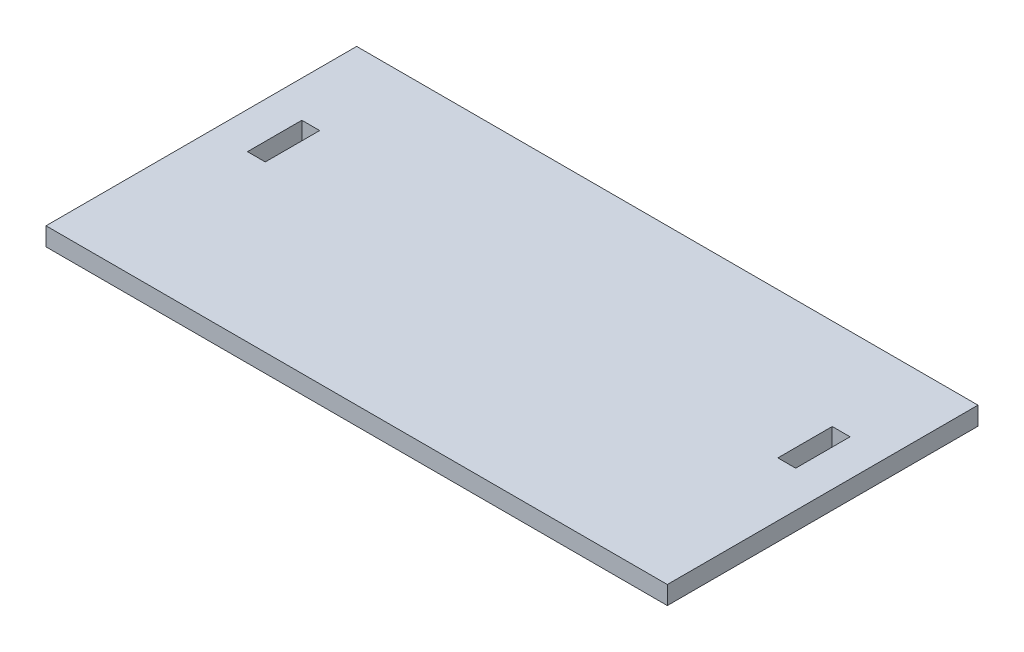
ISO-10303-21;
HEADER;
FILE_DESCRIPTION(('STEP AP214'),'2;1');
FILE_NAME('part.step','',(''),(''),'','','');
FILE_SCHEMA(('AUTOMOTIVE_DESIGN { 1 0 10303 214 1 1 1 1 }'));
ENDSEC;
DATA;
#1=APPLICATION_CONTEXT('core data for automotive mechanical design processes');
#2=APPLICATION_PROTOCOL_DEFINITION('international standard','automotive_design',2000,#1);
#3=PRODUCT_CONTEXT('',#1,'mechanical');
#4=PRODUCT('Part','Part','',(#3));
#5=PRODUCT_RELATED_PRODUCT_CATEGORY('part','',(#4));
#6=PRODUCT_DEFINITION_FORMATION('','',#4);
#7=PRODUCT_DEFINITION_CONTEXT('part definition',#1,'design');
#8=PRODUCT_DEFINITION('design','',#6,#7);
#9=PRODUCT_DEFINITION_SHAPE('','',#8);
#10=(LENGTH_UNIT() NAMED_UNIT(*) SI_UNIT(.MILLI.,.METRE.));
#11=(NAMED_UNIT(*) PLANE_ANGLE_UNIT() SI_UNIT($,.RADIAN.));
#12=(NAMED_UNIT(*) SI_UNIT($,.STERADIAN.) SOLID_ANGLE_UNIT());
#13=UNCERTAINTY_MEASURE_WITH_UNIT(LENGTH_MEASURE(1.E-05),#10,'distance_accuracy_value','');
#14=(GEOMETRIC_REPRESENTATION_CONTEXT(3) GLOBAL_UNCERTAINTY_ASSIGNED_CONTEXT((#13)) GLOBAL_UNIT_ASSIGNED_CONTEXT((#10,
#11,#12)) REPRESENTATION_CONTEXT('',''));
#15=CARTESIAN_POINT('',(0.,0.,0.));
#16=DIRECTION('',(0.,0.,1.));
#17=DIRECTION('',(1.,0.,0.));
#18=AXIS2_PLACEMENT_3D('',#15,#16,#17);
#19=CARTESIAN_POINT('',(0.,10.,0.));
#20=DIRECTION('',(0.,1.,0.));
#21=DIRECTION('',(0.,0.,1.));
#22=AXIS2_PLACEMENT_3D('',#19,#20,#21);
#23=PLANE('',#22);
#24=DIRECTION('',(0.,0.,1.));
#25=VECTOR('',#24,1.);
#26=CARTESIAN_POINT('',(-68.7616014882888,10.,-58.2175310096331));
#27=LINE('',#26,#25);
#28=CARTESIAN_POINT('',(-68.7616014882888,10.,-58.2175310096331));
#29=VERTEX_POINT('',#28);
#30=CARTESIAN_POINT('',(-68.7616014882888,10.,111.782468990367));
#31=VERTEX_POINT('',#30);
#32=EDGE_CURVE('E214',#29,#31,#27,.T.);
#33=ORIENTED_EDGE('',*,*,#32,.T.);
#34=DIRECTION('',(1.,0.,0.));
#35=VECTOR('',#34,1.);
#36=CARTESIAN_POINT('',(-68.7616014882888,10.,111.782468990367));
#37=LINE('',#36,#35);
#38=CARTESIAN_POINT('',(271.238398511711,10.,111.782468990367));
#39=VERTEX_POINT('',#38);
#40=EDGE_CURVE('E219',#31,#39,#37,.T.);
#41=ORIENTED_EDGE('',*,*,#40,.T.);
#42=DIRECTION('',(0.,0.,-1.));
#43=VECTOR('',#42,1.);
#44=CARTESIAN_POINT('',(271.238398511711,10.,-58.2175310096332));
#45=LINE('',#44,#43);
#46=CARTESIAN_POINT('',(271.238398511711,10.,-58.2175310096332));
#47=VERTEX_POINT('',#46);
#48=EDGE_CURVE('E227',#39,#47,#45,.T.);
#49=ORIENTED_EDGE('',*,*,#48,.T.);
#50=DIRECTION('',(-1.,0.,0.));
#51=VECTOR('',#50,1.);
#52=CARTESIAN_POINT('',(-68.7616014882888,10.,-58.2175310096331));
#53=LINE('',#52,#51);
#54=EDGE_CURVE('E230',#47,#29,#53,.T.);
#55=ORIENTED_EDGE('',*,*,#54,.T.);
#56=EDGE_LOOP('',(#33,#41,#49,#55));
#57=FACE_BOUND('',#56,.T.);
#58=DIRECTION('',(1.,0.,0.));
#59=VECTOR('',#58,1.);
#60=CARTESIAN_POINT('',(-48.7616014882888,10.,21.5424689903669));
#61=LINE('',#60,#59);
#62=CARTESIAN_POINT('',(-48.7616014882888,10.,21.5424689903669));
#63=VERTEX_POINT('',#62);
#64=CARTESIAN_POINT('',(-39.0016014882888,10.,21.5424689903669));
#65=VERTEX_POINT('',#64);
#66=EDGE_CURVE('E180',#63,#65,#61,.T.);
#67=ORIENTED_EDGE('',*,*,#66,.F.);
#68=DIRECTION('',(0.,0.,1.));
#69=VECTOR('',#68,1.);
#70=CARTESIAN_POINT('',(-48.7616014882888,10.,-8.21753100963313));
#71=LINE('',#70,#69);
#72=CARTESIAN_POINT('',(-48.7616014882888,10.,-8.21753100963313));
#73=VERTEX_POINT('',#72);
#74=EDGE_CURVE('E176',#73,#63,#71,.T.);
#75=ORIENTED_EDGE('',*,*,#74,.F.);
#76=DIRECTION('',(-1.,0.,0.));
#77=VECTOR('',#76,1.);
#78=CARTESIAN_POINT('',(-48.7616014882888,10.,-8.21753100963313));
#79=LINE('',#78,#77);
#80=CARTESIAN_POINT('',(-39.0016014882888,10.,-8.21753100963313));
#81=VERTEX_POINT('',#80);
#82=EDGE_CURVE('E187',#81,#73,#79,.T.);
#83=ORIENTED_EDGE('',*,*,#82,.F.);
#84=DIRECTION('',(0.,0.,-1.));
#85=VECTOR('',#84,1.);
#86=CARTESIAN_POINT('',(-39.0016014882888,10.,-8.21753100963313));
#87=LINE('',#86,#85);
#88=EDGE_CURVE('E192',#65,#81,#87,.T.);
#89=ORIENTED_EDGE('',*,*,#88,.F.);
#90=EDGE_LOOP('',(#67,#75,#83,#89));
#91=FACE_BOUND('',#90,.T.);
#92=DIRECTION('',(-1.,0.,0.));
#93=VECTOR('',#92,1.);
#94=CARTESIAN_POINT('',(251.238398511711,10.,-8.21753100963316));
#95=LINE('',#94,#93);
#96=CARTESIAN_POINT('',(251.238398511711,10.,-8.21753100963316));
#97=VERTEX_POINT('',#96);
#98=CARTESIAN_POINT('',(241.478398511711,10.,-8.21753100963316));
#99=VERTEX_POINT('',#98);
#100=EDGE_CURVE('E136',#97,#99,#95,.T.);
#101=ORIENTED_EDGE('',*,*,#100,.F.);
#102=DIRECTION('',(0.,0.,-1.));
#103=VECTOR('',#102,1.);
#104=CARTESIAN_POINT('',(251.238398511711,10.,-8.21753100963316));
#105=LINE('',#104,#103);
#106=CARTESIAN_POINT('',(251.238398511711,10.,21.5424689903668));
#107=VERTEX_POINT('',#106);
#108=EDGE_CURVE('E127',#107,#97,#105,.T.);
#109=ORIENTED_EDGE('',*,*,#108,.F.);
#110=DIRECTION('',(1.,0.,0.));
#111=VECTOR('',#110,1.);
#112=CARTESIAN_POINT('',(251.238398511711,10.,21.5424689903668));
#113=LINE('',#112,#111);
#114=CARTESIAN_POINT('',(241.478398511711,10.,21.5424689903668));
#115=VERTEX_POINT('',#114);
#116=EDGE_CURVE('E153',#115,#107,#113,.T.);
#117=ORIENTED_EDGE('',*,*,#116,.F.);
#118=DIRECTION('',(0.,0.,1.));
#119=VECTOR('',#118,1.);
#120=CARTESIAN_POINT('',(241.478398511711,10.,-8.21753100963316));
#121=LINE('',#120,#119);
#122=EDGE_CURVE('E148',#99,#115,#121,.T.);
#123=ORIENTED_EDGE('',*,*,#122,.F.);
#124=EDGE_LOOP('',(#101,#109,#117,#123));
#125=FACE_BOUND('',#124,.T.);
#126=ADVANCED_FACE('F38',(#57,#91,#125),#23,.T.);
#127=CARTESIAN_POINT('',(0.,0.,0.));
#128=DIRECTION('',(0.,1.,0.));
#129=DIRECTION('',(0.,0.,1.));
#130=AXIS2_PLACEMENT_3D('',#127,#128,#129);
#131=PLANE('',#130);
#132=DIRECTION('',(0.,0.,1.));
#133=VECTOR('',#132,1.);
#134=CARTESIAN_POINT('',(-48.7616014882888,0.,-8.21753100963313));
#135=LINE('',#134,#133);
#136=CARTESIAN_POINT('',(-48.7616014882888,0.,-8.21753100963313));
#137=VERTEX_POINT('',#136);
#138=CARTESIAN_POINT('',(-48.7616014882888,0.,21.5424689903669));
#139=VERTEX_POINT('',#138);
#140=EDGE_CURVE('E144',#137,#139,#135,.T.);
#141=ORIENTED_EDGE('',*,*,#140,.T.);
#142=DIRECTION('',(1.,0.,0.));
#143=VECTOR('',#142,1.);
#144=CARTESIAN_POINT('',(-48.7616014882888,0.,21.5424689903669));
#145=LINE('',#144,#143);
#146=CARTESIAN_POINT('',(-39.0016014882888,0.,21.5424689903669));
#147=VERTEX_POINT('',#146);
#148=EDGE_CURVE('E196',#139,#147,#145,.T.);
#149=ORIENTED_EDGE('',*,*,#148,.T.);
#150=DIRECTION('',(0.,0.,-1.));
#151=VECTOR('',#150,1.);
#152=CARTESIAN_POINT('',(-39.0016014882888,0.,-8.21753100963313));
#153=LINE('',#152,#151);
#154=CARTESIAN_POINT('',(-39.0016014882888,0.,-8.21753100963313));
#155=VERTEX_POINT('',#154);
#156=EDGE_CURVE('E199',#147,#155,#153,.T.);
#157=ORIENTED_EDGE('',*,*,#156,.T.);
#158=DIRECTION('',(-1.,0.,0.));
#159=VECTOR('',#158,1.);
#160=CARTESIAN_POINT('',(-48.7616014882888,0.,-8.21753100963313));
#161=LINE('',#160,#159);
#162=EDGE_CURVE('E181',#155,#137,#161,.T.);
#163=ORIENTED_EDGE('',*,*,#162,.T.);
#164=EDGE_LOOP('',(#141,#149,#157,#163));
#165=FACE_BOUND('',#164,.T.);
#166=DIRECTION('',(0.,0.,1.));
#167=VECTOR('',#166,1.);
#168=CARTESIAN_POINT('',(-68.7616014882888,0.,-58.2175310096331));
#169=LINE('',#168,#167);
#170=CARTESIAN_POINT('',(-68.7616014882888,0.,-58.2175310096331));
#171=VERTEX_POINT('',#170);
#172=CARTESIAN_POINT('',(-68.7616014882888,0.,111.782468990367));
#173=VERTEX_POINT('',#172);
#174=EDGE_CURVE('E213',#171,#173,#169,.T.);
#175=ORIENTED_EDGE('',*,*,#174,.F.);
#176=DIRECTION('',(-1.,0.,0.));
#177=VECTOR('',#176,1.);
#178=CARTESIAN_POINT('',(-68.7616014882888,0.,-58.2175310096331));
#179=LINE('',#178,#177);
#180=CARTESIAN_POINT('',(271.238398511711,0.,-58.2175310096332));
#181=VERTEX_POINT('',#180);
#182=EDGE_CURVE('E220',#181,#171,#179,.T.);
#183=ORIENTED_EDGE('',*,*,#182,.F.);
#184=DIRECTION('',(0.,0.,-1.));
#185=VECTOR('',#184,1.);
#186=CARTESIAN_POINT('',(271.238398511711,0.,-58.2175310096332));
#187=LINE('',#186,#185);
#188=CARTESIAN_POINT('',(271.238398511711,0.,111.782468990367));
#189=VERTEX_POINT('',#188);
#190=EDGE_CURVE('E239',#189,#181,#187,.T.);
#191=ORIENTED_EDGE('',*,*,#190,.F.);
#192=DIRECTION('',(1.,0.,0.));
#193=VECTOR('',#192,1.);
#194=CARTESIAN_POINT('',(-68.7616014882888,0.,111.782468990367));
#195=LINE('',#194,#193);
#196=EDGE_CURVE('E237',#173,#189,#195,.T.);
#197=ORIENTED_EDGE('',*,*,#196,.F.);
#198=EDGE_LOOP('',(#175,#183,#191,#197));
#199=FACE_BOUND('',#198,.T.);
#200=DIRECTION('',(0.,0.,-1.));
#201=VECTOR('',#200,1.);
#202=CARTESIAN_POINT('',(251.238398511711,0.,-8.21753100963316));
#203=LINE('',#202,#201);
#204=CARTESIAN_POINT('',(251.238398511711,0.,21.5424689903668));
#205=VERTEX_POINT('',#204);
#206=CARTESIAN_POINT('',(251.238398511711,0.,-8.21753100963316));
#207=VERTEX_POINT('',#206);
#208=EDGE_CURVE('E61',#205,#207,#203,.T.);
#209=ORIENTED_EDGE('',*,*,#208,.T.);
#210=DIRECTION('',(-1.,0.,0.));
#211=VECTOR('',#210,1.);
#212=CARTESIAN_POINT('',(251.238398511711,0.,-8.21753100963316));
#213=LINE('',#212,#211);
#214=CARTESIAN_POINT('',(241.478398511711,0.,-8.21753100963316));
#215=VERTEX_POINT('',#214);
#216=EDGE_CURVE('E143',#207,#215,#213,.T.);
#217=ORIENTED_EDGE('',*,*,#216,.T.);
#218=DIRECTION('',(0.,0.,1.));
#219=VECTOR('',#218,1.);
#220=CARTESIAN_POINT('',(241.478398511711,0.,-8.21753100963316));
#221=LINE('',#220,#219);
#222=CARTESIAN_POINT('',(241.478398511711,0.,21.5424689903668));
#223=VERTEX_POINT('',#222);
#224=EDGE_CURVE('E168',#215,#223,#221,.T.);
#225=ORIENTED_EDGE('',*,*,#224,.T.);
#226=DIRECTION('',(1.,0.,0.));
#227=VECTOR('',#226,1.);
#228=CARTESIAN_POINT('',(251.238398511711,0.,21.5424689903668));
#229=LINE('',#228,#227);
#230=EDGE_CURVE('E137',#223,#205,#229,.T.);
#231=ORIENTED_EDGE('',*,*,#230,.T.);
#232=EDGE_LOOP('',(#209,#217,#225,#231));
#233=FACE_BOUND('',#232,.T.);
#234=ADVANCED_FACE('F257',(#165,#199,#233),#131,.F.);
#235=CARTESIAN_POINT('',(-68.7616014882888,10.,-58.2175310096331));
#236=DIRECTION('',(1.,0.,0.));
#237=DIRECTION('',(0.,0.,-1.));
#238=AXIS2_PLACEMENT_3D('',#235,#236,#237);
#239=PLANE('',#238);
#240=ORIENTED_EDGE('',*,*,#174,.T.);
#241=DIRECTION('',(0.,-1.,0.));
#242=VECTOR('',#241,1.);
#243=CARTESIAN_POINT('',(-68.7616014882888,10.,111.782468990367));
#244=LINE('',#243,#242);
#245=EDGE_CURVE('E12',#31,#173,#244,.T.);
#246=ORIENTED_EDGE('',*,*,#245,.F.);
#247=ORIENTED_EDGE('',*,*,#32,.F.);
#248=DIRECTION('',(0.,-1.,0.));
#249=VECTOR('',#248,1.);
#250=CARTESIAN_POINT('',(-68.7616014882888,10.,-58.2175310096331));
#251=LINE('',#250,#249);
#252=EDGE_CURVE('E234',#29,#171,#251,.T.);
#253=ORIENTED_EDGE('',*,*,#252,.T.);
#254=EDGE_LOOP('',(#240,#246,#247,#253));
#255=FACE_BOUND('',#254,.T.);
#256=ADVANCED_FACE('F40',(#255),#239,.F.);
#257=CARTESIAN_POINT('',(-68.7616014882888,10.,111.782468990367));
#258=DIRECTION('',(0.,0.,-1.));
#259=DIRECTION('',(-1.,0.,0.));
#260=AXIS2_PLACEMENT_3D('',#257,#258,#259);
#261=PLANE('',#260);
#262=ORIENTED_EDGE('',*,*,#196,.T.);
#263=DIRECTION('',(0.,-1.,0.));
#264=VECTOR('',#263,1.);
#265=CARTESIAN_POINT('',(271.238398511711,10.,111.782468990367));
#266=LINE('',#265,#264);
#267=EDGE_CURVE('E46',#39,#189,#266,.T.);
#268=ORIENTED_EDGE('',*,*,#267,.F.);
#269=ORIENTED_EDGE('',*,*,#40,.F.);
#270=ORIENTED_EDGE('',*,*,#245,.T.);
#271=EDGE_LOOP('',(#262,#268,#269,#270));
#272=FACE_BOUND('',#271,.T.);
#273=ADVANCED_FACE('F307',(#272),#261,.F.);
#274=CARTESIAN_POINT('',(271.238398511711,10.,-58.2175310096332));
#275=DIRECTION('',(-1.,0.,0.));
#276=DIRECTION('',(0.,0.,1.));
#277=AXIS2_PLACEMENT_3D('',#274,#275,#276);
#278=PLANE('',#277);
#279=ORIENTED_EDGE('',*,*,#190,.T.);
#280=DIRECTION('',(0.,-1.,0.));
#281=VECTOR('',#280,1.);
#282=CARTESIAN_POINT('',(271.238398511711,10.,-58.2175310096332));
#283=LINE('',#282,#281);
#284=EDGE_CURVE('E244',#47,#181,#283,.T.);
#285=ORIENTED_EDGE('',*,*,#284,.F.);
#286=ORIENTED_EDGE('',*,*,#48,.F.);
#287=ORIENTED_EDGE('',*,*,#267,.T.);
#288=EDGE_LOOP('',(#279,#285,#286,#287));
#289=FACE_BOUND('',#288,.T.);
#290=ADVANCED_FACE('F251',(#289),#278,.F.);
#291=CARTESIAN_POINT('',(-68.7616014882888,10.,-58.2175310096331));
#292=DIRECTION('',(0.,0.,1.));
#293=DIRECTION('',(1.,0.,0.));
#294=AXIS2_PLACEMENT_3D('',#291,#292,#293);
#295=PLANE('',#294);
#296=ORIENTED_EDGE('',*,*,#182,.T.);
#297=ORIENTED_EDGE('',*,*,#252,.F.);
#298=ORIENTED_EDGE('',*,*,#54,.F.);
#299=ORIENTED_EDGE('',*,*,#284,.T.);
#300=EDGE_LOOP('',(#296,#297,#298,#299));
#301=FACE_BOUND('',#300,.T.);
#302=ADVANCED_FACE('F261',(#301),#295,.F.);
#303=CARTESIAN_POINT('',(-48.7616014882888,10.,-8.21753100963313));
#304=DIRECTION('',(1.,0.,0.));
#305=DIRECTION('',(0.,0.,-1.));
#306=AXIS2_PLACEMENT_3D('',#303,#304,#305);
#307=PLANE('',#306);
#308=ORIENTED_EDGE('',*,*,#140,.F.);
#309=DIRECTION('',(0.,-1.,0.));
#310=VECTOR('',#309,1.);
#311=CARTESIAN_POINT('',(-48.7616014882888,10.,-8.21753100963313));
#312=LINE('',#311,#310);
#313=EDGE_CURVE('E191',#73,#137,#312,.T.);
#314=ORIENTED_EDGE('',*,*,#313,.F.);
#315=ORIENTED_EDGE('',*,*,#74,.T.);
#316=DIRECTION('',(0.,-1.,0.));
#317=VECTOR('',#316,1.);
#318=CARTESIAN_POINT('',(-48.7616014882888,10.,21.5424689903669));
#319=LINE('',#318,#317);
#320=EDGE_CURVE('E210',#63,#139,#319,.T.);
#321=ORIENTED_EDGE('',*,*,#320,.T.);
#322=EDGE_LOOP('',(#308,#314,#315,#321));
#323=FACE_BOUND('',#322,.T.);
#324=ADVANCED_FACE('F284',(#323),#307,.T.);
#325=CARTESIAN_POINT('',(-48.7616014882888,10.,21.5424689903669));
#326=DIRECTION('',(0.,0.,-1.));
#327=DIRECTION('',(-1.,0.,0.));
#328=AXIS2_PLACEMENT_3D('',#325,#326,#327);
#329=PLANE('',#328);
#330=ORIENTED_EDGE('',*,*,#148,.F.);
#331=ORIENTED_EDGE('',*,*,#320,.F.);
#332=ORIENTED_EDGE('',*,*,#66,.T.);
#333=DIRECTION('',(0.,-1.,0.));
#334=VECTOR('',#333,1.);
#335=CARTESIAN_POINT('',(-39.0016014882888,10.,21.5424689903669));
#336=LINE('',#335,#334);
#337=EDGE_CURVE('E208',#65,#147,#336,.T.);
#338=ORIENTED_EDGE('',*,*,#337,.T.);
#339=EDGE_LOOP('',(#330,#331,#332,#338));
#340=FACE_BOUND('',#339,.T.);
#341=ADVANCED_FACE('F288',(#340),#329,.T.);
#342=CARTESIAN_POINT('',(-39.0016014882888,10.,-8.21753100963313));
#343=DIRECTION('',(-1.,0.,0.));
#344=DIRECTION('',(0.,0.,1.));
#345=AXIS2_PLACEMENT_3D('',#342,#343,#344);
#346=PLANE('',#345);
#347=ORIENTED_EDGE('',*,*,#156,.F.);
#348=ORIENTED_EDGE('',*,*,#337,.F.);
#349=ORIENTED_EDGE('',*,*,#88,.T.);
#350=DIRECTION('',(0.,-1.,0.));
#351=VECTOR('',#350,1.);
#352=CARTESIAN_POINT('',(-39.0016014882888,10.,-8.21753100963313));
#353=LINE('',#352,#351);
#354=EDGE_CURVE('E206',#81,#155,#353,.T.);
#355=ORIENTED_EDGE('',*,*,#354,.T.);
#356=EDGE_LOOP('',(#347,#348,#349,#355));
#357=FACE_BOUND('',#356,.T.);
#358=ADVANCED_FACE('F276',(#357),#346,.T.);
#359=CARTESIAN_POINT('',(-48.7616014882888,10.,-8.21753100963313));
#360=DIRECTION('',(0.,0.,1.));
#361=DIRECTION('',(1.,0.,0.));
#362=AXIS2_PLACEMENT_3D('',#359,#360,#361);
#363=PLANE('',#362);
#364=ORIENTED_EDGE('',*,*,#162,.F.);
#365=ORIENTED_EDGE('',*,*,#354,.F.);
#366=ORIENTED_EDGE('',*,*,#82,.T.);
#367=ORIENTED_EDGE('',*,*,#313,.T.);
#368=EDGE_LOOP('',(#364,#365,#366,#367));
#369=FACE_BOUND('',#368,.T.);
#370=ADVANCED_FACE('F282',(#369),#363,.T.);
#371=CARTESIAN_POINT('',(251.238398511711,10.,-8.21753100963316));
#372=DIRECTION('',(-1.,0.,0.));
#373=DIRECTION('',(0.,0.,1.));
#374=AXIS2_PLACEMENT_3D('',#371,#372,#373);
#375=PLANE('',#374);
#376=ORIENTED_EDGE('',*,*,#208,.F.);
#377=DIRECTION('',(0.,-1.,0.));
#378=VECTOR('',#377,1.);
#379=CARTESIAN_POINT('',(251.238398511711,10.,21.5424689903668));
#380=LINE('',#379,#378);
#381=EDGE_CURVE('E131',#107,#205,#380,.T.);
#382=ORIENTED_EDGE('',*,*,#381,.F.);
#383=ORIENTED_EDGE('',*,*,#108,.T.);
#384=DIRECTION('',(0.,-1.,0.));
#385=VECTOR('',#384,1.);
#386=CARTESIAN_POINT('',(251.238398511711,10.,-8.21753100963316));
#387=LINE('',#386,#385);
#388=EDGE_CURVE('E130',#97,#207,#387,.T.);
#389=ORIENTED_EDGE('',*,*,#388,.T.);
#390=EDGE_LOOP('',(#376,#382,#383,#389));
#391=FACE_BOUND('',#390,.T.);
#392=ADVANCED_FACE('F129',(#391),#375,.T.);
#393=CARTESIAN_POINT('',(251.238398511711,10.,-8.21753100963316));
#394=DIRECTION('',(0.,0.,1.));
#395=DIRECTION('',(1.,0.,0.));
#396=AXIS2_PLACEMENT_3D('',#393,#394,#395);
#397=PLANE('',#396);
#398=ORIENTED_EDGE('',*,*,#216,.F.);
#399=ORIENTED_EDGE('',*,*,#388,.F.);
#400=ORIENTED_EDGE('',*,*,#100,.T.);
#401=DIRECTION('',(0.,-1.,0.));
#402=VECTOR('',#401,1.);
#403=CARTESIAN_POINT('',(241.478398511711,10.,-8.21753100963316));
#404=LINE('',#403,#402);
#405=EDGE_CURVE('E145',#99,#215,#404,.T.);
#406=ORIENTED_EDGE('',*,*,#405,.T.);
#407=EDGE_LOOP('',(#398,#399,#400,#406));
#408=FACE_BOUND('',#407,.T.);
#409=ADVANCED_FACE('F140',(#408),#397,.T.);
#410=CARTESIAN_POINT('',(241.478398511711,10.,-8.21753100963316));
#411=DIRECTION('',(1.,0.,0.));
#412=DIRECTION('',(0.,0.,-1.));
#413=AXIS2_PLACEMENT_3D('',#410,#411,#412);
#414=PLANE('',#413);
#415=ORIENTED_EDGE('',*,*,#224,.F.);
#416=ORIENTED_EDGE('',*,*,#405,.F.);
#417=ORIENTED_EDGE('',*,*,#122,.T.);
#418=DIRECTION('',(0.,-1.,0.));
#419=VECTOR('',#418,1.);
#420=CARTESIAN_POINT('',(241.478398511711,10.,21.5424689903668));
#421=LINE('',#420,#419);
#422=EDGE_CURVE('E53',#115,#223,#421,.T.);
#423=ORIENTED_EDGE('',*,*,#422,.T.);
#424=EDGE_LOOP('',(#415,#416,#417,#423));
#425=FACE_BOUND('',#424,.T.);
#426=ADVANCED_FACE('F376',(#425),#414,.T.);
#427=CARTESIAN_POINT('',(251.238398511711,10.,21.5424689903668));
#428=DIRECTION('',(0.,0.,-1.));
#429=DIRECTION('',(-1.,0.,0.));
#430=AXIS2_PLACEMENT_3D('',#427,#428,#429);
#431=PLANE('',#430);
#432=ORIENTED_EDGE('',*,*,#230,.F.);
#433=ORIENTED_EDGE('',*,*,#422,.F.);
#434=ORIENTED_EDGE('',*,*,#116,.T.);
#435=ORIENTED_EDGE('',*,*,#381,.T.);
#436=EDGE_LOOP('',(#432,#433,#434,#435));
#437=FACE_BOUND('',#436,.T.);
#438=ADVANCED_FACE('F384',(#437),#431,.T.);
#439=CLOSED_SHELL('',(#126,#234,#256,#273,#290,#302,#324,#341,#358,#370,#392,#409,#426,#438));
#440=MANIFOLD_SOLID_BREP('B2',#439);
#441=ADVANCED_BREP_SHAPE_REPRESENTATION('',(#18,#440),#14);
#442=SHAPE_DEFINITION_REPRESENTATION(#9,#441);
ENDSEC;
END-ISO-10303-21;
